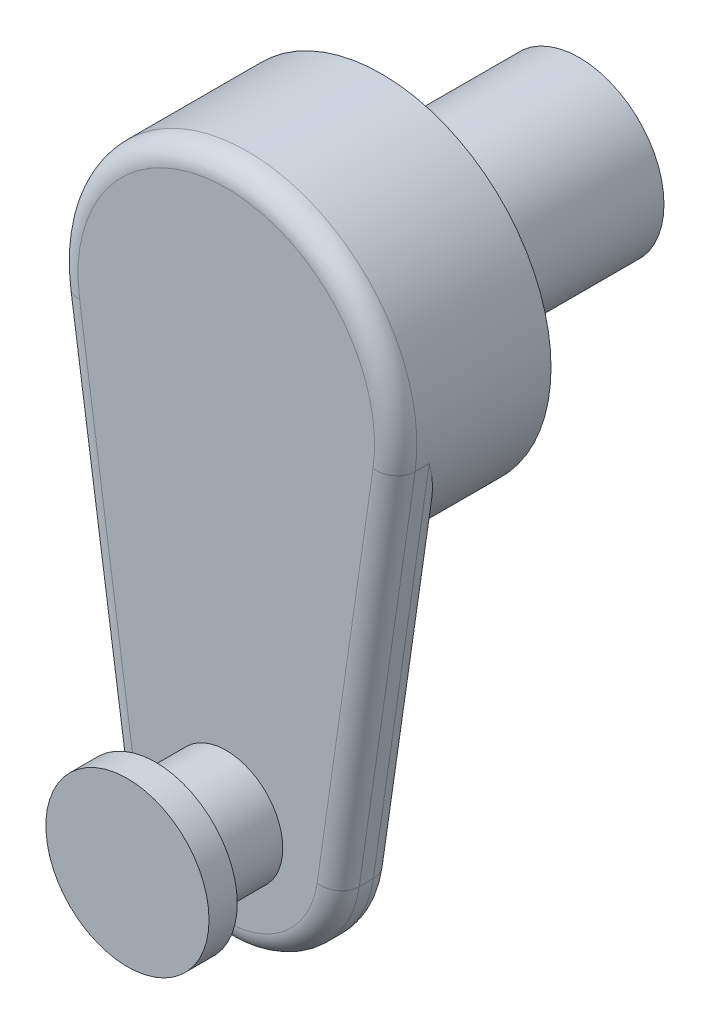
ISO-10303-21;
HEADER;
FILE_DESCRIPTION(('STEP AP214'),'2;1');
FILE_NAME('part.step','',(''),(''),'','','');
FILE_SCHEMA(('AUTOMOTIVE_DESIGN { 1 0 10303 214 1 1 1 1 }'));
ENDSEC;
DATA;
#1=APPLICATION_CONTEXT('core data for automotive mechanical design processes');
#2=APPLICATION_PROTOCOL_DEFINITION('international standard','automotive_design',2000,#1);
#3=PRODUCT_CONTEXT('',#1,'mechanical');
#4=PRODUCT('Part','Part','',(#3));
#5=PRODUCT_RELATED_PRODUCT_CATEGORY('part','',(#4));
#6=PRODUCT_DEFINITION_FORMATION('','',#4);
#7=PRODUCT_DEFINITION_CONTEXT('part definition',#1,'design');
#8=PRODUCT_DEFINITION('design','',#6,#7);
#9=PRODUCT_DEFINITION_SHAPE('','',#8);
#10=(LENGTH_UNIT() NAMED_UNIT(*) SI_UNIT(.MILLI.,.METRE.));
#11=(NAMED_UNIT(*) PLANE_ANGLE_UNIT() SI_UNIT($,.RADIAN.));
#12=(NAMED_UNIT(*) SI_UNIT($,.STERADIAN.) SOLID_ANGLE_UNIT());
#13=UNCERTAINTY_MEASURE_WITH_UNIT(LENGTH_MEASURE(1.E-05),#10,'distance_accuracy_value','');
#14=(GEOMETRIC_REPRESENTATION_CONTEXT(3) GLOBAL_UNCERTAINTY_ASSIGNED_CONTEXT((#13)) GLOBAL_UNIT_ASSIGNED_CONTEXT((#10,
#11,#12)) REPRESENTATION_CONTEXT('',''));
#15=CARTESIAN_POINT('',(0.,0.,0.));
#16=DIRECTION('',(0.,0.,1.));
#17=DIRECTION('',(1.,0.,0.));
#18=AXIS2_PLACEMENT_3D('',#15,#16,#17);
#19=CARTESIAN_POINT('',(0.,0.,5.5));
#20=DIRECTION('',(0.,0.,1.));
#21=DIRECTION('',(1.,0.,0.));
#22=AXIS2_PLACEMENT_3D('',#19,#20,#21);
#23=PLANE('',#22);
#24=DIRECTION('',(0.142857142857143,0.989743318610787,0.));
#25=VECTOR('',#24,1.);
#26=CARTESIAN_POINT('',(5.19615242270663,-0.75,5.5));
#27=LINE('',#26,#25);
#28=CARTESIAN_POINT('',(3.21666578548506,-14.4642857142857,5.5));
#29=VERTEX_POINT('',#28);
#30=CARTESIAN_POINT('',(5.19615242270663,-0.749999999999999,5.5));
#31=VERTEX_POINT('',#30);
#32=EDGE_CURVE('E126',#29,#31,#27,.T.);
#33=ORIENTED_EDGE('',*,*,#32,.T.);
#34=CARTESIAN_POINT('',(0.,0.,5.5));
#35=DIRECTION('',(0.,0.,1.));
#36=DIRECTION('',(1.,0.,0.));
#37=AXIS2_PLACEMENT_3D('',#34,#35,#36);
#38=CIRCLE('',#37,5.25);
#39=CARTESIAN_POINT('',(-5.19615242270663,-0.750000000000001,5.5));
#40=VERTEX_POINT('',#39);
#41=EDGE_CURVE('E107',#31,#40,#38,.T.);
#42=ORIENTED_EDGE('',*,*,#41,.T.);
#43=DIRECTION('',(0.142857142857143,-0.989743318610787,0.));
#44=VECTOR('',#43,1.);
#45=CARTESIAN_POINT('',(-5.19615242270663,-0.750000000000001,5.5));
#46=LINE('',#45,#44);
#47=CARTESIAN_POINT('',(-3.21666578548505,-14.4642857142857,5.5));
#48=VERTEX_POINT('',#47);
#49=EDGE_CURVE('E115',#40,#48,#46,.T.);
#50=ORIENTED_EDGE('',*,*,#49,.T.);
#51=CARTESIAN_POINT('',(0.,-14.,5.5));
#52=DIRECTION('',(0.,0.,1.));
#53=DIRECTION('',(1.,0.,0.));
#54=AXIS2_PLACEMENT_3D('',#51,#52,#53);
#55=CIRCLE('',#54,3.25);
#56=EDGE_CURVE('E121',#48,#29,#55,.T.);
#57=ORIENTED_EDGE('',*,*,#56,.T.);
#58=EDGE_LOOP('',(#33,#42,#50,#57));
#59=FACE_BOUND('',#58,.T.);
#60=CARTESIAN_POINT('',(0.,-14.,5.5));
#61=DIRECTION('',(0.,0.,1.));
#62=DIRECTION('',(1.,0.,0.));
#63=AXIS2_PLACEMENT_3D('',#60,#61,#62);
#64=CIRCLE('',#63,2.);
#65=CARTESIAN_POINT('',(2.,-14.,5.5));
#66=VERTEX_POINT('',#65);
#67=EDGE_CURVE('E277',#66,#66,#64,.T.);
#68=ORIENTED_EDGE('',*,*,#67,.F.);
#69=EDGE_LOOP('',(#68));
#70=FACE_BOUND('',#69,.T.);
#71=ADVANCED_FACE('F33',(#59,#70),#23,.T.);
#72=CARTESIAN_POINT('',(0.,0.,5.5));
#73=DIRECTION('',(0.,0.,-1.));
#74=DIRECTION('',(-1.,0.,0.));
#75=AXIS2_PLACEMENT_3D('',#72,#73,#74);
#76=CYLINDRICAL_SURFACE('',#75,6.);
#77=CARTESIAN_POINT('',(0.,0.,0.));
#78=DIRECTION('',(0.,0.,1.));
#79=DIRECTION('',(1.,0.,0.));
#80=AXIS2_PLACEMENT_3D('',#77,#78,#79);
#81=CIRCLE('',#80,6.);
#82=CARTESIAN_POINT('',(6.,0.,0.));
#83=VERTEX_POINT('',#82);
#84=EDGE_CURVE('E207',#83,#83,#81,.T.);
#85=ORIENTED_EDGE('',*,*,#84,.T.);
#86=EDGE_LOOP('',(#85));
#87=FACE_BOUND('',#86,.T.);
#88=CARTESIAN_POINT('',(0.,0.,3.5));
#89=DIRECTION('',(0.,0.,1.));
#90=DIRECTION('',(1.,0.,0.));
#91=AXIS2_PLACEMENT_3D('',#88,#89,#90);
#92=CIRCLE('',#91,6.);
#93=CARTESIAN_POINT('',(-4.78118992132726,-3.62494454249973,3.5));
#94=VERTEX_POINT('',#93);
#95=CARTESIAN_POINT('',(4.78118992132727,-3.62494454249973,3.5));
#96=VERTEX_POINT('',#95);
#97=EDGE_CURVE('E122',#94,#96,#92,.T.);
#98=ORIENTED_EDGE('',*,*,#97,.F.);
#99=CARTESIAN_POINT('',(-4.78118992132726,-3.62494454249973,3.5));
#100=CARTESIAN_POINT('',(-4.81118601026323,-3.58538208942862,3.50000678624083));
#101=CARTESIAN_POINT('',(-4.84067968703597,-3.54545927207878,3.50115458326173));
#102=CARTESIAN_POINT('',(-4.89860643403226,-3.4649833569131,3.50547628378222));
#103=CARTESIAN_POINT('',(-4.92703995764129,-3.42443053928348,3.50864931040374));
#104=CARTESIAN_POINT('',(-5.01057858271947,-3.3020959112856,3.52080595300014));
#105=CARTESIAN_POINT('',(-5.06405802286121,-3.21945800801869,3.53242949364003));
#106=CARTESIAN_POINT('',(-5.16624644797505,-3.05277210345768,3.56110921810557));
#107=CARTESIAN_POINT('',(-5.21497596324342,-2.96873219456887,3.57814053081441));
#108=CARTESIAN_POINT('',(-5.3079516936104,-2.79910912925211,3.61651796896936));
#109=CARTESIAN_POINT('',(-5.35219457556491,-2.71352488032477,3.63786726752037));
#110=CARTESIAN_POINT('',(-5.46283806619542,-2.48635648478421,3.69858039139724));
#111=CARTESIAN_POINT('',(-5.52549062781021,-2.34368862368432,3.74078065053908));
#112=CARTESIAN_POINT('',(-5.63899737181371,-2.05565311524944,3.83118686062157));
#113=CARTESIAN_POINT('',(-5.68984661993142,-1.91028436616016,3.87939531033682));
#114=CARTESIAN_POINT('',(-5.82508686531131,-1.47051258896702,4.02965245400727));
#115=CARTESIAN_POINT('',(-5.89219088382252,-1.17240137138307,4.13734575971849));
#116=CARTESIAN_POINT('',(-5.93706302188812,-0.866779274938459,4.24655742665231));
#117=CARTESIAN_POINT('',(-5.93776440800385,-0.861961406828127,4.24827875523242));
#118=CARTESIAN_POINT('',(-5.93845991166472,-0.857142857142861,4.25));
#119=B_SPLINE_CURVE_WITH_KNOTS('',3,(#99,#100,#101,#102,#103,#104,#105,#106,#107,#108,#109,#110,
#111,#112,#113,#114,#115,#116,#117,#118),.UNSPECIFIED.,.F.,.F.,(4,2,2,2,2,2,2,2,2,4),(0.,
0.148901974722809,0.297739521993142,0.594739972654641,0.890393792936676,1.1862656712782,
1.66982795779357,2.15359203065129,3.12097449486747,3.13646643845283),.UNSPECIFIED.);
#120=CARTESIAN_POINT('',(-5.93845991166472,-0.857142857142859,4.25));
#121=VERTEX_POINT('',#120);
#122=EDGE_CURVE('E43',#94,#121,#119,.T.);
#123=ORIENTED_EDGE('',*,*,#122,.T.);
#124=DIRECTION('',(0.,0.,1.));
#125=VECTOR('',#124,1.);
#126=CARTESIAN_POINT('',(-5.93845991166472,-0.857142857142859,3.5));
#127=LINE('',#126,#125);
#128=CARTESIAN_POINT('',(-5.93845991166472,-0.857142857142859,4.75));
#129=VERTEX_POINT('',#128);
#130=EDGE_CURVE('E229',#121,#129,#127,.T.);
#131=ORIENTED_EDGE('',*,*,#130,.T.);
#132=CARTESIAN_POINT('',(0.,0.,4.75));
#133=DIRECTION('',(0.,0.,1.));
#134=DIRECTION('',(1.,0.,0.));
#135=AXIS2_PLACEMENT_3D('',#132,#133,#134);
#136=CIRCLE('',#135,6.);
#137=CARTESIAN_POINT('',(5.93845991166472,-0.857142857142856,4.75));
#138=VERTEX_POINT('',#137);
#139=EDGE_CURVE('E109',#129,#138,#136,.F.);
#140=ORIENTED_EDGE('',*,*,#139,.T.);
#141=DIRECTION('',(0.,0.,1.));
#142=VECTOR('',#141,1.);
#143=CARTESIAN_POINT('',(5.93845991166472,-0.857142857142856,3.5));
#144=LINE('',#143,#142);
#145=CARTESIAN_POINT('',(5.93845991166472,-0.857142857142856,4.25));
#146=VERTEX_POINT('',#145);
#147=EDGE_CURVE('E226',#146,#138,#144,.T.);
#148=ORIENTED_EDGE('',*,*,#147,.F.);
#149=CARTESIAN_POINT('',(4.78118992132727,-3.62494454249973,3.5));
#150=CARTESIAN_POINT('',(4.81118601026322,-3.58538208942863,3.50000678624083));
#151=CARTESIAN_POINT('',(4.84067968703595,-3.5454592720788,3.50115458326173));
#152=CARTESIAN_POINT('',(4.89860643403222,-3.46498335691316,3.50547628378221));
#153=CARTESIAN_POINT('',(4.92703995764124,-3.42443053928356,3.50864931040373));
#154=CARTESIAN_POINT('',(5.01057858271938,-3.30209591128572,3.52080595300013));
#155=CARTESIAN_POINT('',(5.06405802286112,-3.21945800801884,3.53242949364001));
#156=CARTESIAN_POINT('',(5.16624644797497,-3.05277210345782,3.56110921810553));
#157=CARTESIAN_POINT('',(5.21497596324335,-2.96873219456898,3.57814053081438));
#158=CARTESIAN_POINT('',(5.30795169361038,-2.79910912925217,3.61651796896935));
#159=CARTESIAN_POINT('',(5.3521945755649,-2.71352488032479,3.63786726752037));
#160=CARTESIAN_POINT('',(5.46283806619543,-2.48635648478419,3.69858039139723));
#161=CARTESIAN_POINT('',(5.52549062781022,-2.34368862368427,3.74078065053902));
#162=CARTESIAN_POINT('',(5.63899737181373,-2.05565311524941,3.83118686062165));
#163=CARTESIAN_POINT('',(5.68984661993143,-1.91028436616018,3.87939531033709));
#164=CARTESIAN_POINT('',(5.82508686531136,-1.47051258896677,4.02965245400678));
#165=CARTESIAN_POINT('',(5.89219088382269,-1.17240137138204,4.13734575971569));
#166=CARTESIAN_POINT('',(5.93706302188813,-0.866779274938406,4.24655742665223));
#167=CARTESIAN_POINT('',(5.93776440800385,-0.861961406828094,4.24827875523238));
#168=CARTESIAN_POINT('',(5.93845991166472,-0.857142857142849,4.25));
#169=B_SPLINE_CURVE_WITH_KNOTS('',3,(#149,#150,#151,#152,#153,#154,#155,#156,#157,#158,#159,
#160,#161,#162,#163,#164,#165,#166,#167,#168),.UNSPECIFIED.,.F.,.F.,(4,2,2,2,2,2,2,2,2,4),(0.,
0.148901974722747,0.297739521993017,0.59473997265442,0.890393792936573,1.1862656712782,
1.6698279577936,2.15359203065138,3.12097449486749,3.13646643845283),.UNSPECIFIED.);
#170=EDGE_CURVE('E11',#146,#96,#169,.F.);
#171=ORIENTED_EDGE('',*,*,#170,.T.);
#172=EDGE_LOOP('',(#98,#123,#131,#140,#148,#171));
#173=FACE_BOUND('',#172,.T.);
#174=ADVANCED_FACE('F167',(#87,#173),#76,.T.);
#175=CARTESIAN_POINT('',(0.,0.,0.));
#176=DIRECTION('',(0.,0.,1.));
#177=DIRECTION('',(1.,0.,0.));
#178=AXIS2_PLACEMENT_3D('',#175,#176,#177);
#179=PLANE('',#178);
#180=ORIENTED_EDGE('',*,*,#84,.F.);
#181=EDGE_LOOP('',(#180));
#182=FACE_BOUND('',#181,.T.);
#183=CARTESIAN_POINT('',(0.,0.,0.));
#184=DIRECTION('',(0.,0.,1.));
#185=DIRECTION('',(1.,0.,0.));
#186=AXIS2_PLACEMENT_3D('',#183,#184,#185);
#187=CIRCLE('',#186,3.);
#188=CARTESIAN_POINT('',(3.,0.,0.));
#189=VERTEX_POINT('',#188);
#190=EDGE_CURVE('E210',#189,#189,#187,.F.);
#191=ORIENTED_EDGE('',*,*,#190,.F.);
#192=EDGE_LOOP('',(#191));
#193=FACE_BOUND('',#192,.T.);
#194=ADVANCED_FACE('F192',(#182,#193),#179,.F.);
#195=CARTESIAN_POINT('',(0.,0.,-7.));
#196=DIRECTION('',(0.,0.,1.));
#197=DIRECTION('',(1.,0.,0.));
#198=AXIS2_PLACEMENT_3D('',#195,#196,#197);
#199=CYLINDRICAL_SURFACE('',#198,3.);
#200=CARTESIAN_POINT('',(0.,0.,-7.));
#201=DIRECTION('',(0.,0.,-1.));
#202=DIRECTION('',(-1.,0.,0.));
#203=AXIS2_PLACEMENT_3D('',#200,#201,#202);
#204=CIRCLE('',#203,3.);
#205=CARTESIAN_POINT('',(-3.,0.,-7.));
#206=VERTEX_POINT('',#205);
#207=EDGE_CURVE('E215',#206,#206,#204,.T.);
#208=ORIENTED_EDGE('',*,*,#207,.F.);
#209=EDGE_LOOP('',(#208));
#210=FACE_BOUND('',#209,.T.);
#211=ORIENTED_EDGE('',*,*,#190,.T.);
#212=EDGE_LOOP('',(#211));
#213=FACE_BOUND('',#212,.T.);
#214=ADVANCED_FACE('F195',(#210,#213),#199,.T.);
#215=CARTESIAN_POINT('',(0.,0.,-7.));
#216=DIRECTION('',(0.,0.,-1.));
#217=DIRECTION('',(-1.,0.,0.));
#218=AXIS2_PLACEMENT_3D('',#215,#216,#217);
#219=PLANE('',#218);
#220=ORIENTED_EDGE('',*,*,#207,.T.);
#221=EDGE_LOOP('',(#220));
#222=FACE_BOUND('',#221,.T.);
#223=ADVANCED_FACE('F202',(#222),#219,.T.);
#224=CARTESIAN_POINT('',(0.,-14.,3.5));
#225=DIRECTION('',(0.,0.,1.));
#226=DIRECTION('',(1.,0.,0.));
#227=AXIS2_PLACEMENT_3D('',#224,#225,#226);
#228=PLANE('',#227);
#229=CARTESIAN_POINT('',(0.,-14.,3.5));
#230=DIRECTION('',(0.,0.,1.));
#231=DIRECTION('',(1.,0.,0.));
#232=AXIS2_PLACEMENT_3D('',#229,#230,#231);
#233=CIRCLE('',#232,3.25);
#234=CARTESIAN_POINT('',(3.21666578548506,-14.4642857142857,3.5));
#235=VERTEX_POINT('',#234);
#236=CARTESIAN_POINT('',(-3.21666578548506,-14.4642857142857,3.5));
#237=VERTEX_POINT('',#236);
#238=EDGE_CURVE('E151',#235,#237,#233,.F.);
#239=ORIENTED_EDGE('',*,*,#238,.T.);
#240=DIRECTION('',(0.142857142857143,-0.989743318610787,0.));
#241=VECTOR('',#240,1.);
#242=CARTESIAN_POINT('',(-5.19615242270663,-0.750000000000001,3.5));
#243=LINE('',#242,#241);
#244=EDGE_CURVE('E155',#237,#94,#243,.F.);
#245=ORIENTED_EDGE('',*,*,#244,.T.);
#246=ORIENTED_EDGE('',*,*,#97,.T.);
#247=DIRECTION('',(0.142857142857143,0.989743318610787,0.));
#248=VECTOR('',#247,1.);
#249=CARTESIAN_POINT('',(3.21666578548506,-14.4642857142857,3.5));
#250=LINE('',#249,#248);
#251=EDGE_CURVE('E153',#96,#235,#250,.F.);
#252=ORIENTED_EDGE('',*,*,#251,.T.);
#253=EDGE_LOOP('',(#239,#245,#246,#252));
#254=FACE_BOUND('',#253,.T.);
#255=ADVANCED_FACE('F244',(#254),#228,.F.);
#256=CARTESIAN_POINT('',(0.,-14.,3.5));
#257=DIRECTION('',(0.,0.,1.));
#258=DIRECTION('',(1.,0.,0.));
#259=AXIS2_PLACEMENT_3D('',#256,#257,#258);
#260=CYLINDRICAL_SURFACE('',#259,4.);
#261=DIRECTION('',(0.,0.,1.));
#262=VECTOR('',#261,1.);
#263=CARTESIAN_POINT('',(-3.95897327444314,-14.5714285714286,3.5));
#264=LINE('',#263,#262);
#265=CARTESIAN_POINT('',(-3.95897327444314,-14.5714285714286,4.25));
#266=VERTEX_POINT('',#265);
#267=CARTESIAN_POINT('',(-3.95897327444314,-14.5714285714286,4.75));
#268=VERTEX_POINT('',#267);
#269=EDGE_CURVE('E233',#266,#268,#264,.T.);
#270=ORIENTED_EDGE('',*,*,#269,.F.);
#271=CARTESIAN_POINT('',(0.,-14.,4.25));
#272=DIRECTION('',(0.,0.,1.));
#273=DIRECTION('',(1.,0.,0.));
#274=AXIS2_PLACEMENT_3D('',#271,#272,#273);
#275=CIRCLE('',#274,4.);
#276=CARTESIAN_POINT('',(3.95897327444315,-14.5714285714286,4.25));
#277=VERTEX_POINT('',#276);
#278=EDGE_CURVE('E51',#266,#277,#275,.T.);
#279=ORIENTED_EDGE('',*,*,#278,.T.);
#280=DIRECTION('',(0.,0.,1.));
#281=VECTOR('',#280,1.);
#282=CARTESIAN_POINT('',(3.95897327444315,-14.5714285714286,3.5));
#283=LINE('',#282,#281);
#284=CARTESIAN_POINT('',(3.95897327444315,-14.5714285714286,4.75));
#285=VERTEX_POINT('',#284);
#286=EDGE_CURVE('E148',#277,#285,#283,.T.);
#287=ORIENTED_EDGE('',*,*,#286,.T.);
#288=CARTESIAN_POINT('',(0.,-14.,4.75));
#289=DIRECTION('',(0.,0.,1.));
#290=DIRECTION('',(1.,0.,0.));
#291=AXIS2_PLACEMENT_3D('',#288,#289,#290);
#292=CIRCLE('',#291,4.);
#293=EDGE_CURVE('E136',#285,#268,#292,.F.);
#294=ORIENTED_EDGE('',*,*,#293,.T.);
#295=EDGE_LOOP('',(#270,#279,#287,#294));
#296=FACE_BOUND('',#295,.T.);
#297=ADVANCED_FACE('F237',(#296),#260,.T.);
#298=CARTESIAN_POINT('',(-3.95897327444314,-14.5714285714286,3.5));
#299=DIRECTION('',(-0.989743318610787,-0.142857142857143,0.));
#300=DIRECTION('',(0.142857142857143,-0.989743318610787,0.));
#301=AXIS2_PLACEMENT_3D('',#298,#299,#300);
#302=PLANE('',#301);
#303=ORIENTED_EDGE('',*,*,#130,.F.);
#304=DIRECTION('',(0.142857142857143,-0.989743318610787,0.));
#305=VECTOR('',#304,1.);
#306=CARTESIAN_POINT('',(-3.95897327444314,-14.5714285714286,4.25));
#307=LINE('',#306,#305);
#308=EDGE_CURVE('E141',#121,#266,#307,.T.);
#309=ORIENTED_EDGE('',*,*,#308,.T.);
#310=ORIENTED_EDGE('',*,*,#269,.T.);
#311=DIRECTION('',(0.142857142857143,-0.989743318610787,0.));
#312=VECTOR('',#311,1.);
#313=CARTESIAN_POINT('',(-3.95897327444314,-14.5714285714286,4.75));
#314=LINE('',#313,#312);
#315=EDGE_CURVE('E139',#268,#129,#314,.F.);
#316=ORIENTED_EDGE('',*,*,#315,.T.);
#317=EDGE_LOOP('',(#303,#309,#310,#316));
#318=FACE_BOUND('',#317,.T.);
#319=ADVANCED_FACE('F235',(#318),#302,.T.);
#320=CARTESIAN_POINT('',(3.95897327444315,-14.5714285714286,3.5));
#321=DIRECTION('',(0.989743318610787,-0.142857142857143,0.));
#322=DIRECTION('',(0.142857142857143,0.989743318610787,0.));
#323=AXIS2_PLACEMENT_3D('',#320,#321,#322);
#324=PLANE('',#323);
#325=ORIENTED_EDGE('',*,*,#286,.F.);
#326=DIRECTION('',(0.142857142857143,0.989743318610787,0.));
#327=VECTOR('',#326,1.);
#328=CARTESIAN_POINT('',(5.93845991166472,-0.857142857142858,4.25));
#329=LINE('',#328,#327);
#330=EDGE_CURVE('E58',#277,#146,#329,.T.);
#331=ORIENTED_EDGE('',*,*,#330,.T.);
#332=ORIENTED_EDGE('',*,*,#147,.T.);
#333=DIRECTION('',(0.142857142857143,0.989743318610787,0.));
#334=VECTOR('',#333,1.);
#335=CARTESIAN_POINT('',(3.95897327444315,-14.5714285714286,4.75));
#336=LINE('',#335,#334);
#337=EDGE_CURVE('E129',#138,#285,#336,.F.);
#338=ORIENTED_EDGE('',*,*,#337,.T.);
#339=EDGE_LOOP('',(#325,#331,#332,#338));
#340=FACE_BOUND('',#339,.T.);
#341=ADVANCED_FACE('F253',(#340),#324,.T.);
#342=CARTESIAN_POINT('',(0.,-14.,4.75));
#343=DIRECTION('',(0.,0.,1.));
#344=DIRECTION('',(1.,0.,0.));
#345=AXIS2_PLACEMENT_3D('',#342,#343,#344);
#346=TOROIDAL_SURFACE('',#345,3.25,0.75);
#347=CARTESIAN_POINT('',(-3.21666578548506,-14.4642857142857,4.75));
#348=DIRECTION('',(-0.142857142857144,0.989743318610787,0.));
#349=DIRECTION('',(-0.989743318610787,-0.142857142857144,0.));
#350=AXIS2_PLACEMENT_3D('',#347,#348,#349);
#351=CIRCLE('',#350,0.75);
#352=EDGE_CURVE('E118',#268,#48,#351,.T.);
#353=ORIENTED_EDGE('',*,*,#352,.F.);
#354=ORIENTED_EDGE('',*,*,#293,.F.);
#355=CARTESIAN_POINT('',(3.21666578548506,-14.4642857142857,4.75));
#356=DIRECTION('',(0.142857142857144,0.989743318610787,0.));
#357=DIRECTION('',(-0.989743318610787,0.142857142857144,0.));
#358=AXIS2_PLACEMENT_3D('',#355,#356,#357);
#359=CIRCLE('',#358,0.75);
#360=EDGE_CURVE('E145',#29,#285,#359,.T.);
#361=ORIENTED_EDGE('',*,*,#360,.F.);
#362=ORIENTED_EDGE('',*,*,#56,.F.);
#363=EDGE_LOOP('',(#353,#354,#361,#362));
#364=FACE_BOUND('',#363,.T.);
#365=ADVANCED_FACE('F178',(#364),#346,.T.);
#366=CARTESIAN_POINT('',(5.19615242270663,-0.75,4.75));
#367=DIRECTION('',(0.142857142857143,0.989743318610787,0.));
#368=DIRECTION('',(-0.989743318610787,0.142857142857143,0.));
#369=AXIS2_PLACEMENT_3D('',#366,#367,#368);
#370=CYLINDRICAL_SURFACE('',#369,0.75);
#371=ORIENTED_EDGE('',*,*,#360,.T.);
#372=ORIENTED_EDGE('',*,*,#337,.F.);
#373=CARTESIAN_POINT('',(5.19615242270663,-0.749999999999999,4.75));
#374=DIRECTION('',(0.142857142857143,0.989743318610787,0.));
#375=DIRECTION('',(-0.989743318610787,0.142857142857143,0.));
#376=AXIS2_PLACEMENT_3D('',#373,#374,#375);
#377=CIRCLE('',#376,0.75);
#378=EDGE_CURVE('E112',#31,#138,#377,.T.);
#379=ORIENTED_EDGE('',*,*,#378,.F.);
#380=ORIENTED_EDGE('',*,*,#32,.F.);
#381=EDGE_LOOP('',(#371,#372,#379,#380));
#382=FACE_BOUND('',#381,.T.);
#383=ADVANCED_FACE('F223',(#382),#370,.T.);
#384=CARTESIAN_POINT('',(-5.19615242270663,-0.750000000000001,4.75));
#385=DIRECTION('',(0.142857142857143,-0.989743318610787,0.));
#386=DIRECTION('',(0.989743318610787,0.142857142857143,0.));
#387=AXIS2_PLACEMENT_3D('',#384,#385,#386);
#388=CYLINDRICAL_SURFACE('',#387,0.75);
#389=ORIENTED_EDGE('',*,*,#352,.T.);
#390=ORIENTED_EDGE('',*,*,#49,.F.);
#391=CARTESIAN_POINT('',(-5.19615242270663,-0.750000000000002,4.75));
#392=DIRECTION('',(-0.142857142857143,0.989743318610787,0.));
#393=DIRECTION('',(-0.989743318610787,-0.142857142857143,0.));
#394=AXIS2_PLACEMENT_3D('',#391,#392,#393);
#395=CIRCLE('',#394,0.75);
#396=EDGE_CURVE('E102',#129,#40,#395,.T.);
#397=ORIENTED_EDGE('',*,*,#396,.F.);
#398=ORIENTED_EDGE('',*,*,#315,.F.);
#399=EDGE_LOOP('',(#389,#390,#397,#398));
#400=FACE_BOUND('',#399,.T.);
#401=ADVANCED_FACE('F116',(#400),#388,.T.);
#402=CARTESIAN_POINT('',(0.,0.,4.75));
#403=DIRECTION('',(0.,0.,1.));
#404=DIRECTION('',(1.,0.,0.));
#405=AXIS2_PLACEMENT_3D('',#402,#403,#404);
#406=TOROIDAL_SURFACE('',#405,5.25,0.75);
#407=ORIENTED_EDGE('',*,*,#378,.T.);
#408=ORIENTED_EDGE('',*,*,#139,.F.);
#409=ORIENTED_EDGE('',*,*,#396,.T.);
#410=ORIENTED_EDGE('',*,*,#41,.F.);
#411=EDGE_LOOP('',(#407,#408,#409,#410));
#412=FACE_BOUND('',#411,.T.);
#413=ADVANCED_FACE('F105',(#412),#406,.T.);
#414=CARTESIAN_POINT('',(3.21666578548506,-14.4642857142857,4.25));
#415=DIRECTION('',(-0.142857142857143,-0.989743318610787,0.));
#416=DIRECTION('',(0.989743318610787,-0.142857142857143,0.));
#417=AXIS2_PLACEMENT_3D('',#414,#415,#416);
#418=CYLINDRICAL_SURFACE('',#417,0.75);
#419=ORIENTED_EDGE('',*,*,#170,.F.);
#420=ORIENTED_EDGE('',*,*,#330,.F.);
#421=CARTESIAN_POINT('',(3.21666578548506,-14.4642857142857,4.25));
#422=DIRECTION('',(-0.142857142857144,-0.989743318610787,0.));
#423=DIRECTION('',(0.989743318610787,-0.142857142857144,0.));
#424=AXIS2_PLACEMENT_3D('',#421,#422,#423);
#425=CIRCLE('',#424,0.75);
#426=EDGE_CURVE('E38',#235,#277,#425,.T.);
#427=ORIENTED_EDGE('',*,*,#426,.F.);
#428=ORIENTED_EDGE('',*,*,#251,.F.);
#429=EDGE_LOOP('',(#419,#420,#427,#428));
#430=FACE_BOUND('',#429,.T.);
#431=ADVANCED_FACE('F35',(#430),#418,.T.);
#432=CARTESIAN_POINT('',(0.,-14.,4.25));
#433=DIRECTION('',(0.,0.,1.));
#434=DIRECTION('',(1.,0.,0.));
#435=AXIS2_PLACEMENT_3D('',#432,#433,#434);
#436=TOROIDAL_SURFACE('',#435,3.25,0.75);
#437=ORIENTED_EDGE('',*,*,#426,.T.);
#438=ORIENTED_EDGE('',*,*,#278,.F.);
#439=CARTESIAN_POINT('',(-3.21666578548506,-14.4642857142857,4.25));
#440=DIRECTION('',(-0.142857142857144,0.989743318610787,0.));
#441=DIRECTION('',(-0.989743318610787,-0.142857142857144,0.));
#442=AXIS2_PLACEMENT_3D('',#439,#440,#441);
#443=CIRCLE('',#442,0.75);
#444=EDGE_CURVE('E287',#237,#266,#443,.T.);
#445=ORIENTED_EDGE('',*,*,#444,.F.);
#446=ORIENTED_EDGE('',*,*,#238,.F.);
#447=EDGE_LOOP('',(#437,#438,#445,#446));
#448=FACE_BOUND('',#447,.T.);
#449=ADVANCED_FACE('F176',(#448),#436,.T.);
#450=CARTESIAN_POINT('',(-3.21666578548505,-14.4642857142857,4.25));
#451=DIRECTION('',(-0.142857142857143,0.989743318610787,0.));
#452=DIRECTION('',(-0.989743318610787,-0.142857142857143,0.));
#453=AXIS2_PLACEMENT_3D('',#450,#451,#452);
#454=CYLINDRICAL_SURFACE('',#453,0.75);
#455=ORIENTED_EDGE('',*,*,#122,.F.);
#456=ORIENTED_EDGE('',*,*,#244,.F.);
#457=ORIENTED_EDGE('',*,*,#444,.T.);
#458=ORIENTED_EDGE('',*,*,#308,.F.);
#459=EDGE_LOOP('',(#455,#456,#457,#458));
#460=FACE_BOUND('',#459,.T.);
#461=ADVANCED_FACE('F171',(#460),#454,.T.);
#462=CARTESIAN_POINT('',(0.,-14.,8.));
#463=DIRECTION('',(0.,0.,-1.));
#464=DIRECTION('',(-1.,0.,0.));
#465=AXIS2_PLACEMENT_3D('',#462,#463,#464);
#466=CYLINDRICAL_SURFACE('',#465,2.);
#467=CARTESIAN_POINT('',(0.,-14.,8.));
#468=DIRECTION('',(0.,0.,1.));
#469=DIRECTION('',(1.,0.,0.));
#470=AXIS2_PLACEMENT_3D('',#467,#468,#469);
#471=CIRCLE('',#470,2.);
#472=CARTESIAN_POINT('',(2.,-14.,8.));
#473=VERTEX_POINT('',#472);
#474=EDGE_CURVE('E281',#473,#473,#471,.T.);
#475=ORIENTED_EDGE('',*,*,#474,.F.);
#476=EDGE_LOOP('',(#475));
#477=FACE_BOUND('',#476,.T.);
#478=ORIENTED_EDGE('',*,*,#67,.T.);
#479=EDGE_LOOP('',(#478));
#480=FACE_BOUND('',#479,.T.);
#481=ADVANCED_FACE('F175',(#477,#480),#466,.T.);
#482=CARTESIAN_POINT('',(0.,-14.,8.));
#483=DIRECTION('',(0.,0.,1.));
#484=DIRECTION('',(1.,0.,0.));
#485=AXIS2_PLACEMENT_3D('',#482,#483,#484);
#486=PLANE('',#485);
#487=CARTESIAN_POINT('',(0.,-14.,8.));
#488=DIRECTION('',(0.,0.,1.));
#489=DIRECTION('',(1.,0.,0.));
#490=AXIS2_PLACEMENT_3D('',#487,#488,#489);
#491=CIRCLE('',#490,2.88884523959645);
#492=CARTESIAN_POINT('',(2.88884523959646,-14.,8.));
#493=VERTEX_POINT('',#492);
#494=EDGE_CURVE('E278',#493,#493,#491,.T.);
#495=ORIENTED_EDGE('',*,*,#494,.F.);
#496=EDGE_LOOP('',(#495));
#497=FACE_BOUND('',#496,.T.);
#498=ORIENTED_EDGE('',*,*,#474,.T.);
#499=EDGE_LOOP('',(#498));
#500=FACE_BOUND('',#499,.T.);
#501=ADVANCED_FACE('F260',(#497,#500),#486,.F.);
#502=CARTESIAN_POINT('',(0.,-14.,9.));
#503=DIRECTION('',(0.,0.,-1.));
#504=DIRECTION('',(-1.,0.,0.));
#505=AXIS2_PLACEMENT_3D('',#502,#503,#504);
#506=CYLINDRICAL_SURFACE('',#505,2.88884523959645);
#507=CARTESIAN_POINT('',(0.,-14.,9.));
#508=DIRECTION('',(0.,0.,1.));
#509=DIRECTION('',(1.,0.,0.));
#510=AXIS2_PLACEMENT_3D('',#507,#508,#509);
#511=CIRCLE('',#510,2.88884523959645);
#512=CARTESIAN_POINT('',(2.88884523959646,-14.,9.));
#513=VERTEX_POINT('',#512);
#514=EDGE_CURVE('E276',#513,#513,#511,.T.);
#515=ORIENTED_EDGE('',*,*,#514,.F.);
#516=EDGE_LOOP('',(#515));
#517=FACE_BOUND('',#516,.T.);
#518=ORIENTED_EDGE('',*,*,#494,.T.);
#519=EDGE_LOOP('',(#518));
#520=FACE_BOUND('',#519,.T.);
#521=ADVANCED_FACE('F262',(#517,#520),#506,.T.);
#522=CARTESIAN_POINT('',(0.,-14.,9.));
#523=DIRECTION('',(0.,0.,1.));
#524=DIRECTION('',(1.,0.,0.));
#525=AXIS2_PLACEMENT_3D('',#522,#523,#524);
#526=PLANE('',#525);
#527=ORIENTED_EDGE('',*,*,#514,.T.);
#528=EDGE_LOOP('',(#527));
#529=FACE_BOUND('',#528,.T.);
#530=ADVANCED_FACE('F265',(#529),#526,.T.);
#531=CLOSED_SHELL('',(#71,#174,#194,#214,#223,#255,#297,#319,#341,#365,#383,#401,#413,#431,#449,
#461,#481,#501,#521,#530));
#532=MANIFOLD_SOLID_BREP('B2',#531);
#533=ADVANCED_BREP_SHAPE_REPRESENTATION('',(#18,#532),#14);
#534=SHAPE_DEFINITION_REPRESENTATION(#9,#533);
ENDSEC;
END-ISO-10303-21;
